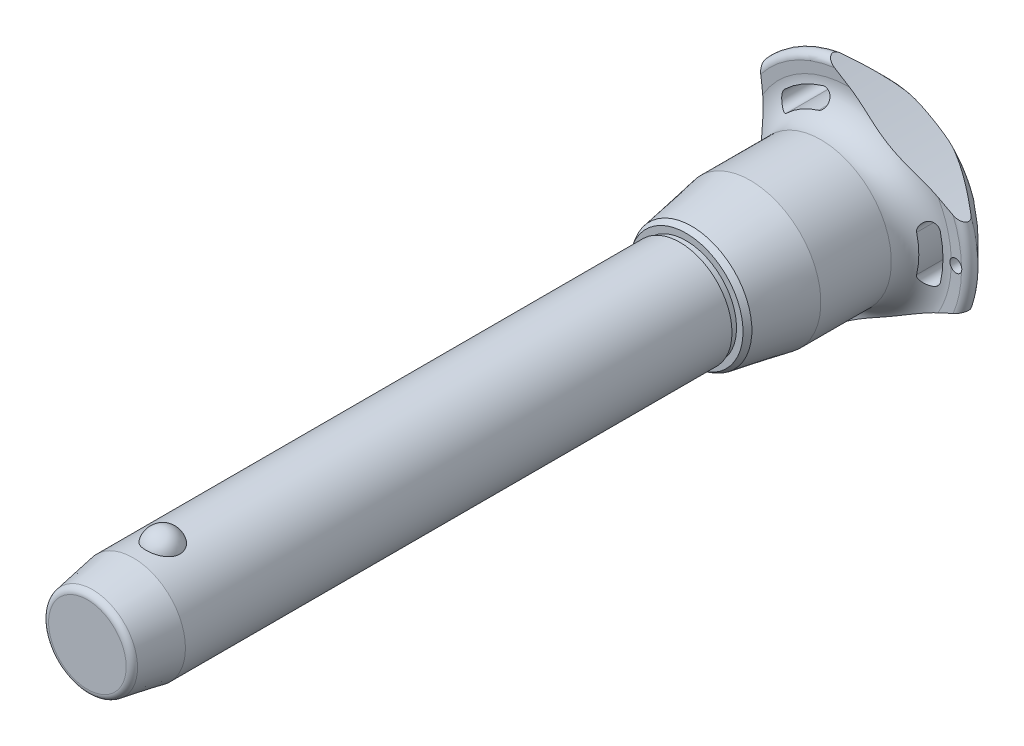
from build123d import *

# Parameters (mm, degrees)
SKETCH1_R           = 12.5
BOSS_EXTRUDE1_DEPTH = 120
SKETCH2_R           = 10
BOSS_EXTRUDE2_DEPTH = 50.7
BOSS_EXTRUDE3_START = 22
SKETCH1_2_R         = 12.5
BOSS_EXTRUDE3_DEPTH = 22
CHAMFER1_SIZE       = 11
CHAMFER1_SIZE2      = 1.939596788
FILLET1_R           = 1.5
SKETCH6_R           = 176.92625
CUT_EXTRUDE1_DEPTH  = 176.410549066
CIRPATTERN1_COUNT   = 3
SKETCH7_R           = 1.5
CUT_EXTRUDE2_DEPTH  = 176.323744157


with BuildPart() as part:
    # Sketch1 → Boss-Extrude1 (new body)
    with BuildSketch(Plane.XY):
        Circle(SKETCH1_R)
    extrude(amount=-BOSS_EXTRUDE1_DEPTH)

    # Sketch2 → Boss-Extrude2 (add)
    with BuildSketch(Plane(origin=(0, 0, -120), x_dir=(-1, 0, 0), z_dir=(0, 0, -1))):
        with Locations(Location((0, 0, 0), (0, 0, 180))):
            Circle(SKETCH2_R)
    extrude(amount=BOSS_EXTRUDE2_DEPTH)

    # Sketch3 → Revolve1 (revolve)
    with BuildSketch(Plane(origin=(0, 0, 0), x_dir=(0, 0, -1), z_dir=(1, 0, 0))):
        with BuildLine():
            Line((-3.957271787, 15.4), (-3.957271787, 7.1))
            ThreePointArc((-3.957271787, 7.1), (0.192728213, 11.25), (-3.957271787, 15.4))
        make_face()
        with BuildLine():
            Line((-3.957271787, -7.1), (-3.957271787, -15.4))
            ThreePointArc((-3.957271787, -15.4), (0.192728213, -11.25), (-3.957271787, -7.1))
        make_face()
    revolve(axis=Axis((0, -7.1, 3.957271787), (0, 1, 0)))

    # Sketch1_2 → Boss-Extrude3 (add)
    with BuildSketch(Plane.XY.offset(BOSS_EXTRUDE3_START)):
        Circle(SKETCH1_2_R)
    extrude(amount=-BOSS_EXTRUDE3_DEPTH)

    # Chamfer1
    chamfer1_edges = [part.edges().sort_by_distance(p)[0] for p in [
        (-12.5, 0, 22),
    ]]
    chamfer1_side = [part.faces().sort_by_distance(p)[0] for p in [
        (-12.5, 0, -49),
    ]]
    chamfer(chamfer1_edges, length=CHAMFER1_SIZE, length2=CHAMFER1_SIZE2, reference=chamfer1_side[0])

    # Fillet1
    fillet1_edges = [part.edges().sort_by_distance(p)[0] for p in [
        (-10.560403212, 0, 22),
        (-10, 0, -170.7),
    ]]
    fillet(fillet1_edges, radius=FILLET1_R)

    # Sketch4 → Revolve2 (revolve)
    with BuildSketch(Plane(origin=(0, 0, 0), x_dir=(0, 0, -1), z_dir=(1, 0, 0)), mode=Mode.PRIVATE) as revolve2_sk:
        Polygon((120, 0), (120, 12.089202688), (121.5, 12.089202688), (121.5, 13.644437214), (122.846872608, 14.422054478), (136.9, 16.9), (153.8, 16.9), (153.8, 0), align=None)
    revolve(revolve2_sk.sketch.rotate(Axis((0, 0, -153.8), (0, 0, 1)), 90), axis=Axis((0, 0, -153.8), (0, 0, 1)))

    # Sketch5 → Revolve3 (revolve)
    with BuildSketch(Plane(origin=(0, 0, 0), x_dir=(0, 0, -1), z_dir=(1, 0, 0)), mode=Mode.PRIVATE) as revolve3_sk:
        with BuildLine():
            Line((160.790129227, 24.271609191), (160.652256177, 26.865060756))
            ThreePointArc((160.652256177, 26.865060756), (161.598671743, 28.411427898), (163.38137085, 28.08137085))
            Line((163.38137085, 28.08137085), (169.763226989, 21.69951471))
            ThreePointArc((169.763226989, 21.69951471), (170.7, 19.381044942), (169.683055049, 17.096604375))
            ThreePointArc((169.683055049, 17.096604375), (164.18864484, 9.321268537), (162.25, 0))
            Line((162.25, 0), (153.8, 0))
            Line((153.8, 0), (153.8, 16.9))
            ThreePointArc((153.8, 16.9), (158.879432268, 19.083427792), (160.790129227, 24.271609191))
        make_face()
    revolve(revolve3_sk.sketch.rotate(Axis((0, 0, -162.25), (0, 0, 1)), 90), axis=Axis((0, 0, -162.25), (0, 0, 1)))

    # Sketch6 → Cut-Extrude1 (cut, through all)
    with BuildSketch(Plane.XY):
        with Locations((-197.42625, 0)):
            Circle(SKETCH6_R)
        with BuildLine():
            ThreePointArc((21.802992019, -5.260839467), (22.428706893, 0), (21.802992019, 5.260839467))
            ThreePointArc((21.802992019, 5.260839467), (19.579234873, 6.620060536), (18.220013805, 4.39630339))
            ThreePointArc((18.220013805, 4.39630339), (18.742902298, 0), (18.220013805, -4.39630339))
            ThreePointArc((18.220013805, -4.39630339), (19.579234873, -6.620060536), (21.802992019, -5.260839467))
        make_face()
    cut_extrude1 = extrude(amount=-CUT_EXTRUDE1_DEPTH, mode=Mode.SUBTRACT)

    # CirPattern1: Cut-Extrude1 ×3 about axis
    cirpattern1_axis = Axis((0, 0, 0), (0, 0, 1))
    for i in range(1, CIRPATTERN1_COUNT):
        add(cut_extrude1.rotate(cirpattern1_axis, i * 360 / CIRPATTERN1_COUNT), mode=Mode.SUBTRACT)

    # Sketch7 → Cut-Extrude2 (cut, through all)
    with BuildSketch(Plane.XY):
        with Locations(Location((25.428706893, 0, 0), (0, 0, 17.230769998))):
            Circle(SKETCH7_R)
    extrude(amount=-CUT_EXTRUDE2_DEPTH, mode=Mode.SUBTRACT)


solid = part.part
